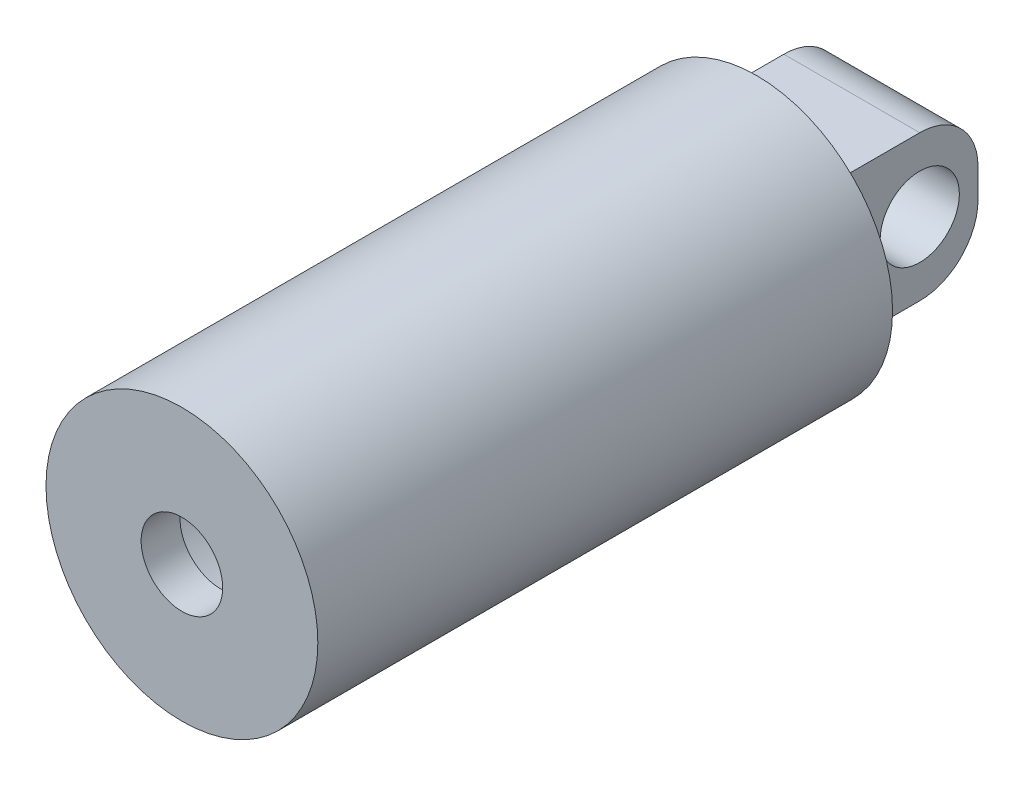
from build123d import *

# Parameters (mm, degrees)
SKETCH1_R           = 44.45
SKETCH1_R_2         = 38.1
BOSS_EXTRUDE1_DEPTH = 190.5
SKETCH2_R           = 44.45
SKETCH2_R_2         = 13.335
BOSS_EXTRUDE2_DEPTH = 12.7
BOSS_EXTRUDE3_START = -12.7
SKETCH3_R           = 44.45
BOSS_EXTRUDE3_DEPTH = 12.7
SKETCH4_W           = 44.45
SKETCH4_H           = 47.625
BOSS_EXTRUDE4_DEPTH = 47.625
FILLET1_R           = 19.05
SKETCH5_R           = 12.954
CUT_EXTRUDE1_DEPTH  = 54.61
CUT_EXTRUDE2_START  = -2.54
SKETCH7_R           = 44.45
SKETCH7_W           = 44.45
SKETCH7_H           = 47.625
CUT_EXTRUDE2_DEPTH  = 2.54


with BuildPart() as part:
    # Sketch1 → Boss-Extrude1 (new body)
    with BuildSketch(Plane.XY):
        Circle(SKETCH1_R)
        Circle(SKETCH1_R_2, mode=Mode.SUBTRACT)
    extrude(amount=-BOSS_EXTRUDE1_DEPTH)

    # Sketch2 → Boss-Extrude2 (add)
    with BuildSketch(Plane.XY):
        Circle(SKETCH2_R)
        Circle(SKETCH2_R_2, mode=Mode.SUBTRACT)
    extrude(amount=-BOSS_EXTRUDE2_DEPTH)

    # Sketch3 → Boss-Extrude3 (add)
    with BuildSketch(Plane(origin=(0, 0, -190.5), x_dir=(-1, 0, 0), z_dir=(0, 0, -1)).offset(BOSS_EXTRUDE3_START)):
        with Locations(Location((0, 0, 0), (0, 0, 180))):
            Circle(SKETCH3_R)
    extrude(amount=BOSS_EXTRUDE3_DEPTH)

    # Sketch4 → Boss-Extrude4 (add)
    with BuildSketch(Plane(origin=(0, 0, -190.5), x_dir=(-1, 0, 0), z_dir=(0, 0, -1))):
        Rectangle(SKETCH4_W, SKETCH4_H)
    extrude(amount=BOSS_EXTRUDE4_DEPTH)

    # Fillet1
    fillet1_edges = [part.edges().sort_by_distance(p)[0] for p in [
        (0, 23.8125, -238.125),
        (0, -23.8125, -238.125),
    ]]
    fillet(fillet1_edges, radius=FILLET1_R)

    # Sketch5 → Cut-Extrude1 (cut)
    with BuildSketch(Plane(origin=(22.225, 0, 0), x_dir=(0, 0, -1), z_dir=(1, 0, 0))):
        with Locations(Location((219.075, 0, 0), (0, 0, 90))):
            Circle(SKETCH5_R)
    extrude(amount=-CUT_EXTRUDE1_DEPTH, mode=Mode.SUBTRACT)

    # Sketch7 → Cut-Extrude2 (cut)
    with BuildSketch(Plane(origin=(0, 0, -190.5), x_dir=(-1, 0, 0), z_dir=(0, 0, -1)).offset(CUT_EXTRUDE2_START)):
        with Locations(Location((0, 0, 0), (0, 0, 180))):
            Circle(SKETCH7_R)
        Rectangle(SKETCH7_W, SKETCH7_H, mode=Mode.SUBTRACT)
    extrude(amount=CUT_EXTRUDE2_DEPTH, mode=Mode.SUBTRACT)


solid = part.part
